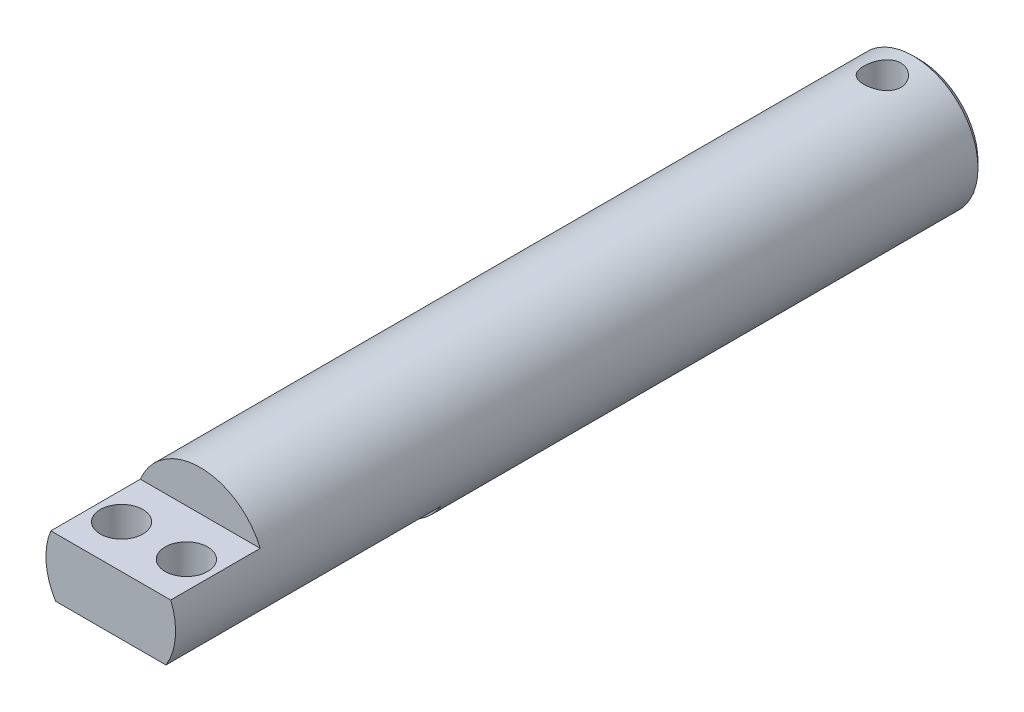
from build123d import *

# Parameters (mm, degrees)
ESQUISSE1_R             = 10.5
BASE_EXTRUSION_DEPTH    = 131
ENL_V_START             = -14.5
ENL_V_MAT_EXTRU_1_DEPTH = 14.5
ENL_V_START_2           = -44.5
ENL_V_MAT_EXTRU_2_DEPTH = 44.5
ESQUISSE4_R             = 3.45
ENL_V_MAT_EXTRU_3_DEPTH = 133.217623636
ESQUISSE5_R             = 3
ENL_V_MAT_EXTRU_4_DEPTH = 134.087377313
CHANFREIN1_SIZE         = 1


with BuildPart() as part:
    # Esquisse1 → Base-Extrusion (new body)
    with BuildSketch(Plane.XY):
        with Locations(Location((0, 0, 0), (0, 0, 157.607312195))):
            Circle(ESQUISSE1_R)
    extrude(amount=BASE_EXTRUSION_DEPTH)

    # Esquisse2 → Enl_v. mat.-Extru.1 (cut)
    with BuildSketch(Plane.XY.offset(131).offset(ENL_V_START)):
        with BuildLine():
            Line((-9.708243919, 4), (9.708243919, 4))
            ThreePointArc((9.708243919, 4), (0, 10.5), (-9.708243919, 4))
        make_face()
    extrude(amount=ENL_V_MAT_EXTRU_1_DEPTH, mode=Mode.SUBTRACT)

    # Esquisse3 → Enl_v. mat.-Extru.2 (cut)
    with BuildSketch(Plane.XY.offset(131).offset(ENL_V_START_2)):
        with BuildLine():
            Line((-8.94427191, -5.5), (8.94427191, -5.5))
            ThreePointArc((8.94427191, -5.5), (0, -10.5), (-8.94427191, -5.5))
        make_face()
    extrude(amount=ENL_V_MAT_EXTRU_2_DEPTH, mode=Mode.SUBTRACT)

    # Esquisse4 → Enl_v. mat.-Extru.3 (cut, through all)
    with BuildSketch(Plane(origin=(0, 4, 0), x_dir=(-1, 0, 0), z_dir=(0, 1, 0))):
        with Locations(Location((-5.25, 124, 0), (0, 0, 90))):
            Circle(ESQUISSE4_R)
        with Locations(Location((5.25, 124, 0), (0, 0, 90))):
            Circle(ESQUISSE4_R)
    extrude(amount=-ENL_V_MAT_EXTRU_3_DEPTH, mode=Mode.SUBTRACT)

    # Esquisse5 → Enl_v. mat.-Extru.4 (cut, through all)
    with BuildSketch(Plane(origin=(0, 10.5, 0), x_dir=(-1, 0, 0), z_dir=(0, 1, 0))):
        with Locations(Location((0, 6, 0), (0, 0, 90))):
            Circle(ESQUISSE5_R)
    extrude(amount=-ENL_V_MAT_EXTRU_4_DEPTH, mode=Mode.SUBTRACT)

    # Chanfrein1
    chanfrein1_edges = [part.edges().sort_by_distance(p)[0] for p in [
        (9.70824392, -4, 0),
    ]]
    chamfer(chanfrein1_edges, length=CHANFREIN1_SIZE)


solid = part.part
